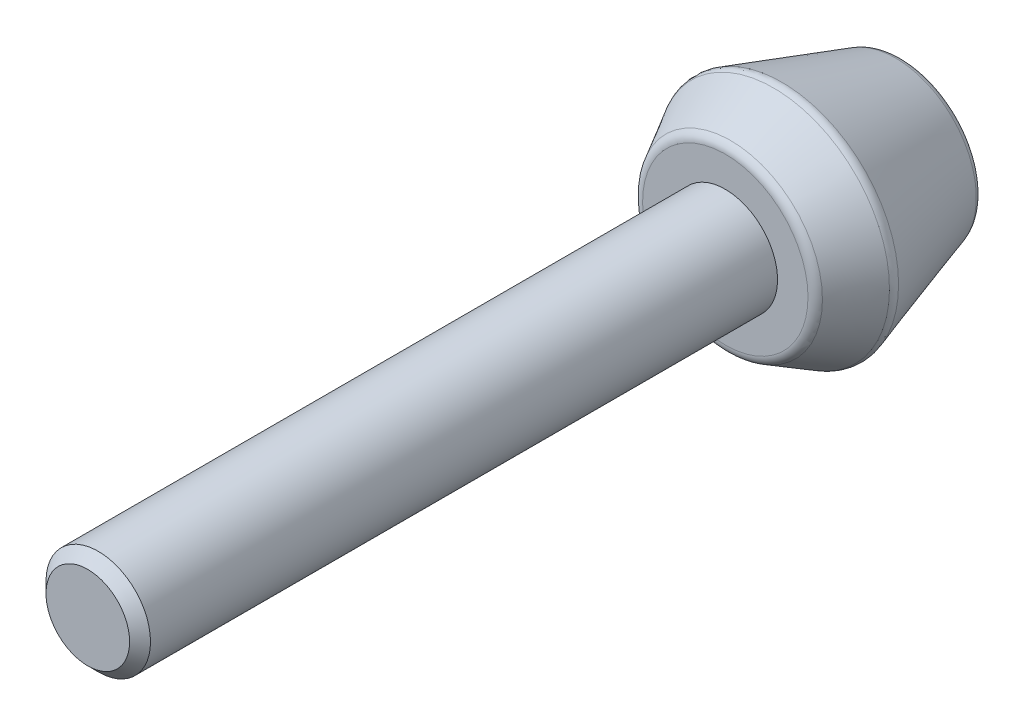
ISO-10303-21;
HEADER;
FILE_DESCRIPTION(('STEP AP214'),'2;1');
FILE_NAME('part.step','',(''),(''),'','','');
FILE_SCHEMA(('AUTOMOTIVE_DESIGN { 1 0 10303 214 1 1 1 1 }'));
ENDSEC;
DATA;
#1=APPLICATION_CONTEXT('core data for automotive mechanical design processes');
#2=APPLICATION_PROTOCOL_DEFINITION('international standard','automotive_design',2000,#1);
#3=PRODUCT_CONTEXT('',#1,'mechanical');
#4=PRODUCT('Part','Part','',(#3));
#5=PRODUCT_RELATED_PRODUCT_CATEGORY('part','',(#4));
#6=PRODUCT_DEFINITION_FORMATION('','',#4);
#7=PRODUCT_DEFINITION_CONTEXT('part definition',#1,'design');
#8=PRODUCT_DEFINITION('design','',#6,#7);
#9=PRODUCT_DEFINITION_SHAPE('','',#8);
#10=(LENGTH_UNIT() NAMED_UNIT(*) SI_UNIT(.MILLI.,.METRE.));
#11=(NAMED_UNIT(*) PLANE_ANGLE_UNIT() SI_UNIT($,.RADIAN.));
#12=(NAMED_UNIT(*) SI_UNIT($,.STERADIAN.) SOLID_ANGLE_UNIT());
#13=UNCERTAINTY_MEASURE_WITH_UNIT(LENGTH_MEASURE(1.E-05),#10,'distance_accuracy_value','');
#14=(GEOMETRIC_REPRESENTATION_CONTEXT(3) GLOBAL_UNCERTAINTY_ASSIGNED_CONTEXT((#13)) GLOBAL_UNIT_ASSIGNED_CONTEXT((#10,
#11,#12)) REPRESENTATION_CONTEXT('',''));
#15=CARTESIAN_POINT('',(0.,0.,0.));
#16=DIRECTION('',(0.,0.,1.));
#17=DIRECTION('',(1.,0.,0.));
#18=AXIS2_PLACEMENT_3D('',#15,#16,#17);
#19=CARTESIAN_POINT('',(0.,0.,2.));
#20=DIRECTION('',(0.,0.,1.));
#21=DIRECTION('',(-0.647135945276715,-0.762374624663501,0.));
#22=AXIS2_PLACEMENT_3D('',#19,#20,#21);
#23=CYLINDRICAL_SURFACE('',#22,2.5);
#24=CARTESIAN_POINT('',(0.,0.,38.5));
#25=DIRECTION('',(0.,0.,1.));
#26=DIRECTION('',(1.,0.,0.));
#27=AXIS2_PLACEMENT_3D('',#24,#25,#26);
#28=CIRCLE('',#27,2.5);
#29=CARTESIAN_POINT('',(2.49999999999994,0.,38.5));
#30=VERTEX_POINT('',#29);
#31=EDGE_CURVE('E9',#30,#30,#28,.F.);
#32=ORIENTED_EDGE('',*,*,#31,.T.);
#33=EDGE_LOOP('',(#32));
#34=FACE_BOUND('',#33,.T.);
#35=CARTESIAN_POINT('',(0.,0.,8.5));
#36=DIRECTION('',(0.,0.,1.));
#37=DIRECTION('',(-0.55730654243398,-0.830306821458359,0.));
#38=AXIS2_PLACEMENT_3D('',#35,#36,#37);
#39=CIRCLE('',#38,2.5);
#40=CARTESIAN_POINT('',(-1.39326635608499,-2.07576705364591,8.5));
#41=VERTEX_POINT('',#40);
#42=EDGE_CURVE('E47',#41,#41,#39,.T.);
#43=ORIENTED_EDGE('',*,*,#42,.T.);
#44=EDGE_LOOP('',(#43));
#45=FACE_BOUND('',#44,.T.);
#46=ADVANCED_FACE('F14',(#34,#45),#23,.T.);
#47=CARTESIAN_POINT('',(0.,0.,8.5));
#48=DIRECTION('',(0.,0.,-1.));
#49=DIRECTION('',(0.55730654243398,0.830306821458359,0.));
#50=AXIS2_PLACEMENT_3D('',#47,#48,#49);
#51=PLANE('',#50);
#52=ORIENTED_EDGE('',*,*,#42,.F.);
#53=EDGE_LOOP('',(#52));
#54=FACE_BOUND('',#53,.T.);
#55=CARTESIAN_POINT('',(0.,0.,8.5));
#56=DIRECTION('',(0.,0.,-1.));
#57=DIRECTION('',(0.557306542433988,0.830306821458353,0.));
#58=AXIS2_PLACEMENT_3D('',#55,#56,#57);
#59=CIRCLE('',#58,3.95693804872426);
#60=CARTESIAN_POINT('',(2.20522746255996,3.28547265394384,8.5));
#61=VERTEX_POINT('',#60);
#62=CARTESIAN_POINT('',(-2.20522746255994,-3.28547265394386,8.5));
#63=VERTEX_POINT('',#62);
#64=EDGE_CURVE('E39',#61,#63,#59,.T.);
#65=ORIENTED_EDGE('',*,*,#64,.F.);
#66=CARTESIAN_POINT('',(0.,0.,8.5));
#67=DIRECTION('',(0.,0.,-1.));
#68=DIRECTION('',(-0.55730654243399,-0.830306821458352,0.));
#69=AXIS2_PLACEMENT_3D('',#66,#67,#68);
#70=CIRCLE('',#69,3.95693804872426);
#71=EDGE_CURVE('E42',#63,#61,#70,.T.);
#72=ORIENTED_EDGE('',*,*,#71,.F.);
#73=EDGE_LOOP('',(#65,#72));
#74=FACE_BOUND('',#73,.T.);
#75=ADVANCED_FACE('F44',(#54,#74),#51,.F.);
#76=CARTESIAN_POINT('',(0.,0.,8.));
#77=DIRECTION('',(0.,0.,-1.));
#78=DIRECTION('',(0.557306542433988,0.830306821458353,0.));
#79=AXIS2_PLACEMENT_3D('',#76,#77,#78);
#80=TOROIDAL_SURFACE('',#79,3.95693804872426,0.5);
#81=CARTESIAN_POINT('',(0.,0.,8.24430168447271));
#82=DIRECTION('',(0.,0.,-1.));
#83=DIRECTION('',(0.55730654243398,0.830306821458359,0.));
#84=AXIS2_PLACEMENT_3D('',#81,#82,#83);
#85=CIRCLE('',#84,4.39319105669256);
#86=CARTESIAN_POINT('',(2.44835411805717,3.64769650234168,8.24430168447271));
#87=VERTEX_POINT('',#86);
#88=EDGE_CURVE('E52',#87,#87,#85,.T.);
#89=ORIENTED_EDGE('',*,*,#88,.F.);
#90=EDGE_LOOP('',(#89));
#91=FACE_BOUND('',#90,.T.);
#92=ORIENTED_EDGE('',*,*,#64,.T.);
#93=ORIENTED_EDGE('',*,*,#71,.T.);
#94=EDGE_LOOP('',(#92,#93));
#95=FACE_BOUND('',#94,.T.);
#96=ADVANCED_FACE('F51',(#91,#95),#80,.T.);
#97=CARTESIAN_POINT('',(0.,0.,6.18887432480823));
#98=DIRECTION('',(0.,0.,-1.));
#99=DIRECTION('',(0.55730654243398,0.830306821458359,0.));
#100=AXIS2_PLACEMENT_3D('',#97,#98,#99);
#101=CONICAL_SURFACE('',#100,5.54423037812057,0.510488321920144);
#102=CARTESIAN_POINT('',(0.,0.,6.18887432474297));
#103=DIRECTION('',(0.,0.,-1.));
#104=DIRECTION('',(0.55730654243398,0.830306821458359,0.));
#105=AXIS2_PLACEMENT_3D('',#102,#103,#104);
#106=CIRCLE('',#105,5.54423037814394);
#107=CARTESIAN_POINT('',(3.08983586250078,4.60341230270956,6.18887432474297));
#108=VERTEX_POINT('',#107);
#109=EDGE_CURVE('E91',#108,#108,#106,.T.);
#110=ORIENTED_EDGE('',*,*,#109,.F.);
#111=EDGE_LOOP('',(#110));
#112=FACE_BOUND('',#111,.T.);
#113=ORIENTED_EDGE('',*,*,#88,.T.);
#114=EDGE_LOOP('',(#113));
#115=FACE_BOUND('',#114,.T.);
#116=ADVANCED_FACE('F71',(#112,#115),#101,.T.);
#117=CARTESIAN_POINT('',(0.,0.,5.94457264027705));
#118=DIRECTION('',(0.,0.,-1.));
#119=DIRECTION('',(0.557306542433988,0.830306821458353,0.));
#120=AXIS2_PLACEMENT_3D('',#117,#118,#119);
#121=TOROIDAL_SURFACE('',#120,5.10797737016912,0.5);
#122=CARTESIAN_POINT('',(0.,0.,5.79362678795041));
#123=DIRECTION('',(0.,0.,1.));
#124=DIRECTION('',(-0.55730654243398,-0.830306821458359,0.));
#125=AXIS2_PLACEMENT_3D('',#122,#123,#124);
#126=CIRCLE('',#125,5.58464848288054);
#127=CARTESIAN_POINT('',(-3.11236113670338,-4.6369717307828,5.79362678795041));
#128=VERTEX_POINT('',#127);
#129=EDGE_CURVE('E90',#128,#128,#126,.F.);
#130=ORIENTED_EDGE('',*,*,#129,.F.);
#131=EDGE_LOOP('',(#130));
#132=FACE_BOUND('',#131,.T.);
#133=ORIENTED_EDGE('',*,*,#109,.T.);
#134=EDGE_LOOP('',(#133));
#135=FACE_BOUND('',#134,.T.);
#136=ADVANCED_FACE('F109',(#132,#135),#121,.T.);
#137=CARTESIAN_POINT('',(0.,0.,5.79362678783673));
#138=DIRECTION('',(0.,0.,1.));
#139=DIRECTION('',(-0.55730654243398,-0.830306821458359,0.));
#140=AXIS2_PLACEMENT_3D('',#137,#138,#139);
#141=CONICAL_SURFACE('',#140,5.58464848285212,0.306676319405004);
#142=ORIENTED_EDGE('',*,*,#129,.T.);
#143=EDGE_LOOP('',(#142));
#144=FACE_BOUND('',#143,.T.);
#145=CARTESIAN_POINT('',(0.,0.,0.3490541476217));
#146=DIRECTION('',(0.,0.,1.));
#147=DIRECTION('',(-0.55730654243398,-0.830306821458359,0.));
#148=AXIS2_PLACEMENT_3D('',#145,#146,#147);
#149=CIRCLE('',#148,3.86053381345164);
#150=CARTESIAN_POINT('',(-2.15150075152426,-3.20542755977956,0.3490541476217));
#151=VERTEX_POINT('',#150);
#152=EDGE_CURVE('E80',#151,#151,#149,.T.);
#153=ORIENTED_EDGE('',*,*,#152,.T.);
#154=EDGE_LOOP('',(#153));
#155=FACE_BOUND('',#154,.T.);
#156=ADVANCED_FACE('F107',(#144,#155),#141,.T.);
#157=CARTESIAN_POINT('',(0.,0.,0.5));
#158=DIRECTION('',(0.,0.,-1.));
#159=DIRECTION('',(0.557306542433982,0.830306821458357,0.));
#160=AXIS2_PLACEMENT_3D('',#157,#158,#159);
#161=TOROIDAL_SURFACE('',#160,3.38386270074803,0.5);
#162=CARTESIAN_POINT('',(0.,0.,0.));
#163=DIRECTION('',(0.,0.,1.));
#164=DIRECTION('',(0.557306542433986,0.830306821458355,0.));
#165=AXIS2_PLACEMENT_3D('',#162,#163,#164);
#166=CIRCLE('',#165,3.38386270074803);
#167=CARTESIAN_POINT('',(1.88584882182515,2.80964428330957,0.));
#168=VERTEX_POINT('',#167);
#169=CARTESIAN_POINT('',(-1.88584882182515,-2.80964428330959,0.));
#170=VERTEX_POINT('',#169);
#171=EDGE_CURVE('E30',#168,#170,#166,.T.);
#172=ORIENTED_EDGE('',*,*,#171,.T.);
#173=CARTESIAN_POINT('',(0.,0.,0.));
#174=DIRECTION('',(0.,0.,1.));
#175=DIRECTION('',(-0.557306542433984,-0.830306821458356,0.));
#176=AXIS2_PLACEMENT_3D('',#173,#174,#175);
#177=CIRCLE('',#176,3.38386270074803);
#178=EDGE_CURVE('E119',#170,#168,#177,.T.);
#179=ORIENTED_EDGE('',*,*,#178,.T.);
#180=EDGE_LOOP('',(#172,#179));
#181=FACE_BOUND('',#180,.T.);
#182=ORIENTED_EDGE('',*,*,#152,.F.);
#183=EDGE_LOOP('',(#182));
#184=FACE_BOUND('',#183,.T.);
#185=ADVANCED_FACE('F97',(#181,#184),#161,.T.);
#186=CARTESIAN_POINT('',(0.,0.,0.));
#187=DIRECTION('',(0.,0.,-1.));
#188=DIRECTION('',(0.55730654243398,0.830306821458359,0.));
#189=AXIS2_PLACEMENT_3D('',#186,#187,#188);
#190=PLANE('',#189);
#191=ORIENTED_EDGE('',*,*,#178,.F.);
#192=ORIENTED_EDGE('',*,*,#171,.F.);
#193=EDGE_LOOP('',(#191,#192));
#194=FACE_BOUND('',#193,.T.);
#195=ADVANCED_FACE('F73',(#194),#190,.T.);
#196=CARTESIAN_POINT('',(0.,0.,39.));
#197=DIRECTION('',(0.,0.,1.));
#198=DIRECTION('',(1.,0.,0.));
#199=AXIS2_PLACEMENT_3D('',#196,#197,#198);
#200=PLANE('',#199);
#201=CARTESIAN_POINT('',(0.,0.,39.));
#202=DIRECTION('',(0.,0.,1.));
#203=DIRECTION('',(1.,0.,0.));
#204=AXIS2_PLACEMENT_3D('',#201,#202,#203);
#205=CIRCLE('',#204,2.);
#206=CARTESIAN_POINT('',(1.99999999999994,0.,39.));
#207=VERTEX_POINT('',#206);
#208=EDGE_CURVE('E23',#207,#207,#205,.T.);
#209=ORIENTED_EDGE('',*,*,#208,.T.);
#210=EDGE_LOOP('',(#209));
#211=FACE_BOUND('',#210,.T.);
#212=ADVANCED_FACE('F178',(#211),#200,.T.);
#213=CARTESIAN_POINT('',(0.,0.,39.));
#214=DIRECTION('',(0.,0.,-1.));
#215=DIRECTION('',(-1.,0.,0.));
#216=AXIS2_PLACEMENT_3D('',#213,#214,#215);
#217=CONICAL_SURFACE('',#216,2.,0.785398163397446);
#218=ORIENTED_EDGE('',*,*,#31,.F.);
#219=EDGE_LOOP('',(#218));
#220=FACE_BOUND('',#219,.T.);
#221=ORIENTED_EDGE('',*,*,#208,.F.);
#222=EDGE_LOOP('',(#221));
#223=FACE_BOUND('',#222,.T.);
#224=ADVANCED_FACE('F16',(#220,#223),#217,.T.);
#225=CLOSED_SHELL('',(#46,#75,#96,#116,#136,#156,#185,#195,#212,#224));
#226=MANIFOLD_SOLID_BREP('B1',#225);
#227=ADVANCED_BREP_SHAPE_REPRESENTATION('',(#18,#226),#14);
#228=SHAPE_DEFINITION_REPRESENTATION(#9,#227);
ENDSEC;
END-ISO-10303-21;
